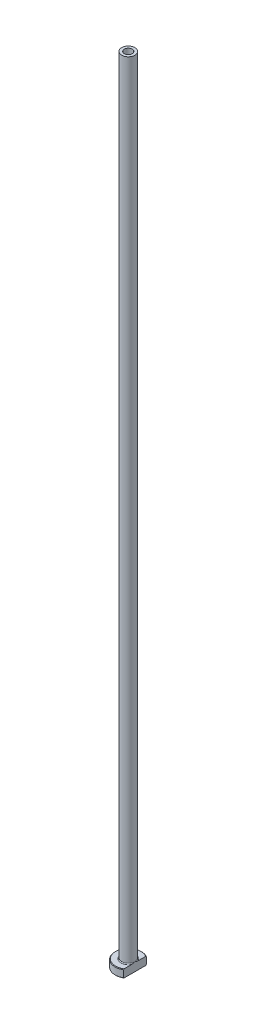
from build123d import *

# Parameters (mm, degrees)
FILLET1_R          = 0.3
CHAMFER1_SIZE      = 0.2
CUT_EXTRUDE1_DEPTH = 301.083321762
CHAMFER2_SIZE      = 0.5


with BuildPart() as part:
    # Sketch1 → Revolve1 (revolve)
    with BuildSketch(Plane.XY, mode=Mode.PRIVATE) as revolve1_sk:
        Polygon((-1.5, 300), (-2.5, 300), (-2.5, 3), (-5, 3), (-5, 0), (-1.75, 0), (-1.75, 243), (-1.5, 255), align=None)
    revolve(revolve1_sk.sketch.rotate(Axis((0, 92.187680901, 0), (0, -1, 0)), 270), axis=Axis((0, 92.187680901, 0), (0, -1, 0)))

    # Fillet1
    fillet1_edges = [part.edges().sort_by_distance(p)[0] for p in [
        (0, 3, -2.5),
    ]]
    fillet(fillet1_edges, radius=FILLET1_R)

    # Chamfer1
    chamfer1_edges = [part.edges().sort_by_distance(p)[0] for p in [
        (0, 0, -5),
        (0, 3, -5),
    ]]
    chamfer(chamfer1_edges, length=CHAMFER1_SIZE)

    # Sketch2 → Cut-Extrude1 (cut, through all)
    with BuildSketch(Plane.XZ):
        with BuildLine():
            Line((2.5, 4.330127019), (2.5, -4.330127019))
            ThreePointArc((2.5, -4.330127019), (5, 0), (2.5, 4.330127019))
        make_face()
    extrude(amount=-CUT_EXTRUDE1_DEPTH, mode=Mode.SUBTRACT)

    # Chamfer2
    chamfer2_edges = [part.edges().sort_by_distance(p)[0] for p in [
        (0, 0, -1.75),
    ]]
    chamfer(chamfer2_edges, length=CHAMFER2_SIZE)


solid = part.part
